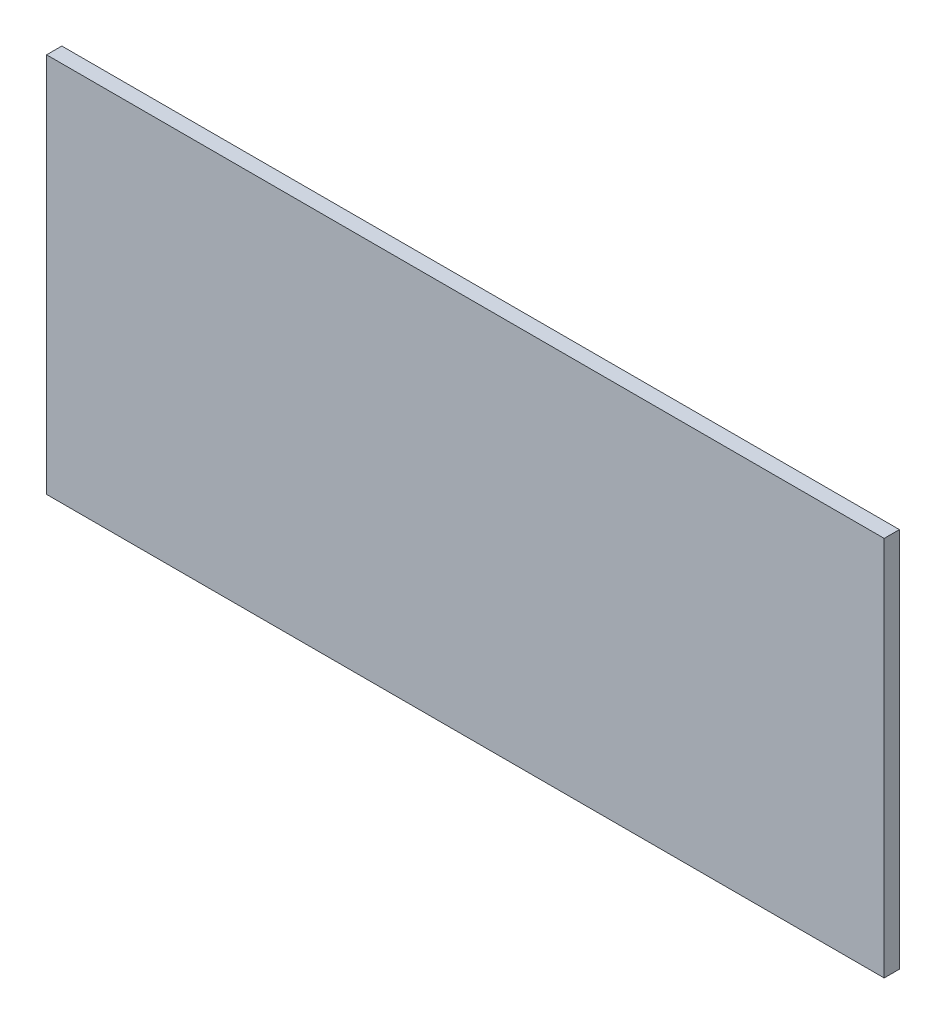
ISO-10303-21;
HEADER;
FILE_DESCRIPTION(('STEP AP214'),'2;1');
FILE_NAME('part.step','',(''),(''),'','','');
FILE_SCHEMA(('AUTOMOTIVE_DESIGN { 1 0 10303 214 1 1 1 1 }'));
ENDSEC;
DATA;
#1=APPLICATION_CONTEXT('core data for automotive mechanical design processes');
#2=APPLICATION_PROTOCOL_DEFINITION('international standard','automotive_design',2000,#1);
#3=PRODUCT_CONTEXT('',#1,'mechanical');
#4=PRODUCT('Part','Part','',(#3));
#5=PRODUCT_RELATED_PRODUCT_CATEGORY('part','',(#4));
#6=PRODUCT_DEFINITION_FORMATION('','',#4);
#7=PRODUCT_DEFINITION_CONTEXT('part definition',#1,'design');
#8=PRODUCT_DEFINITION('design','',#6,#7);
#9=PRODUCT_DEFINITION_SHAPE('','',#8);
#10=(LENGTH_UNIT() NAMED_UNIT(*) SI_UNIT(.MILLI.,.METRE.));
#11=(NAMED_UNIT(*) PLANE_ANGLE_UNIT() SI_UNIT($,.RADIAN.));
#12=(NAMED_UNIT(*) SI_UNIT($,.STERADIAN.) SOLID_ANGLE_UNIT());
#13=UNCERTAINTY_MEASURE_WITH_UNIT(LENGTH_MEASURE(1.E-05),#10,'distance_accuracy_value','');
#14=(GEOMETRIC_REPRESENTATION_CONTEXT(3) GLOBAL_UNCERTAINTY_ASSIGNED_CONTEXT((#13)) GLOBAL_UNIT_ASSIGNED_CONTEXT((#10,
#11,#12)) REPRESENTATION_CONTEXT('',''));
#15=CARTESIAN_POINT('',(0.,0.,0.));
#16=DIRECTION('',(0.,0.,1.));
#17=DIRECTION('',(1.,0.,0.));
#18=AXIS2_PLACEMENT_3D('',#15,#16,#17);
#19=CARTESIAN_POINT('',(-5500.,2500.,200.));
#20=DIRECTION('',(1.,0.,0.));
#21=DIRECTION('',(0.,1.,0.));
#22=AXIS2_PLACEMENT_3D('',#19,#20,#21);
#23=PLANE('',#22);
#24=DIRECTION('',(0.,-1.,0.));
#25=VECTOR('',#24,1.);
#26=CARTESIAN_POINT('',(-5500.,2500.,0.));
#27=LINE('',#26,#25);
#28=CARTESIAN_POINT('',(-5500.,2500.,0.));
#29=VERTEX_POINT('',#28);
#30=CARTESIAN_POINT('',(-5500.,-2500.,0.));
#31=VERTEX_POINT('',#30);
#32=EDGE_CURVE('E101',#29,#31,#27,.T.);
#33=ORIENTED_EDGE('',*,*,#32,.T.);
#34=DIRECTION('',(0.,0.,-1.));
#35=VECTOR('',#34,1.);
#36=CARTESIAN_POINT('',(-5500.,-2500.,200.));
#37=LINE('',#36,#35);
#38=CARTESIAN_POINT('',(-5500.,-2500.,200.));
#39=VERTEX_POINT('',#38);
#40=EDGE_CURVE('E11',#39,#31,#37,.T.);
#41=ORIENTED_EDGE('',*,*,#40,.F.);
#42=DIRECTION('',(0.,-1.,0.));
#43=VECTOR('',#42,1.);
#44=CARTESIAN_POINT('',(-5500.,2500.,200.));
#45=LINE('',#44,#43);
#46=CARTESIAN_POINT('',(-5500.,2500.,200.));
#47=VERTEX_POINT('',#46);
#48=EDGE_CURVE('E89',#47,#39,#45,.T.);
#49=ORIENTED_EDGE('',*,*,#48,.F.);
#50=DIRECTION('',(0.,0.,-1.));
#51=VECTOR('',#50,1.);
#52=CARTESIAN_POINT('',(-5500.,2500.,200.));
#53=LINE('',#52,#51);
#54=EDGE_CURVE('E97',#47,#29,#53,.T.);
#55=ORIENTED_EDGE('',*,*,#54,.T.);
#56=EDGE_LOOP('',(#33,#41,#49,#55));
#57=FACE_BOUND('',#56,.T.);
#58=ADVANCED_FACE('F38',(#57),#23,.F.);
#59=CARTESIAN_POINT('',(-5500.,-2500.,200.));
#60=DIRECTION('',(0.,1.,0.));
#61=DIRECTION('',(0.,0.,1.));
#62=AXIS2_PLACEMENT_3D('',#59,#60,#61);
#63=PLANE('',#62);
#64=DIRECTION('',(1.,0.,0.));
#65=VECTOR('',#64,1.);
#66=CARTESIAN_POINT('',(-5500.,-2500.,0.));
#67=LINE('',#66,#65);
#68=CARTESIAN_POINT('',(5500.,-2500.,0.));
#69=VERTEX_POINT('',#68);
#70=EDGE_CURVE('E93',#31,#69,#67,.T.);
#71=ORIENTED_EDGE('',*,*,#70,.T.);
#72=DIRECTION('',(0.,0.,-1.));
#73=VECTOR('',#72,1.);
#74=CARTESIAN_POINT('',(5500.,-2500.,200.));
#75=LINE('',#74,#73);
#76=CARTESIAN_POINT('',(5500.,-2500.,200.));
#77=VERTEX_POINT('',#76);
#78=EDGE_CURVE('E46',#77,#69,#75,.T.);
#79=ORIENTED_EDGE('',*,*,#78,.F.);
#80=DIRECTION('',(1.,0.,0.));
#81=VECTOR('',#80,1.);
#82=CARTESIAN_POINT('',(-5500.,-2500.,200.));
#83=LINE('',#82,#81);
#84=EDGE_CURVE('E84',#39,#77,#83,.T.);
#85=ORIENTED_EDGE('',*,*,#84,.F.);
#86=ORIENTED_EDGE('',*,*,#40,.T.);
#87=EDGE_LOOP('',(#71,#79,#85,#86));
#88=FACE_BOUND('',#87,.T.);
#89=ADVANCED_FACE('F92',(#88),#63,.F.);
#90=CARTESIAN_POINT('',(5500.,2500.,200.));
#91=DIRECTION('',(-1.,0.,0.));
#92=DIRECTION('',(0.,-1.,0.));
#93=AXIS2_PLACEMENT_3D('',#90,#91,#92);
#94=PLANE('',#93);
#95=DIRECTION('',(0.,1.,0.));
#96=VECTOR('',#95,1.);
#97=CARTESIAN_POINT('',(5500.,2500.,0.));
#98=LINE('',#97,#96);
#99=CARTESIAN_POINT('',(5500.,2500.,0.));
#100=VERTEX_POINT('',#99);
#101=EDGE_CURVE('E71',#69,#100,#98,.T.);
#102=ORIENTED_EDGE('',*,*,#101,.T.);
#103=DIRECTION('',(0.,0.,-1.));
#104=VECTOR('',#103,1.);
#105=CARTESIAN_POINT('',(5500.,2500.,200.));
#106=LINE('',#105,#104);
#107=CARTESIAN_POINT('',(5500.,2500.,200.));
#108=VERTEX_POINT('',#107);
#109=EDGE_CURVE('E94',#108,#100,#106,.T.);
#110=ORIENTED_EDGE('',*,*,#109,.F.);
#111=DIRECTION('',(0.,1.,0.));
#112=VECTOR('',#111,1.);
#113=CARTESIAN_POINT('',(5500.,2500.,200.));
#114=LINE('',#113,#112);
#115=EDGE_CURVE('E87',#77,#108,#114,.T.);
#116=ORIENTED_EDGE('',*,*,#115,.F.);
#117=ORIENTED_EDGE('',*,*,#78,.T.);
#118=EDGE_LOOP('',(#102,#110,#116,#117));
#119=FACE_BOUND('',#118,.T.);
#120=ADVANCED_FACE('F95',(#119),#94,.F.);
#121=CARTESIAN_POINT('',(-5500.,2500.,200.));
#122=DIRECTION('',(0.,-1.,0.));
#123=DIRECTION('',(0.,0.,-1.));
#124=AXIS2_PLACEMENT_3D('',#121,#122,#123);
#125=PLANE('',#124);
#126=DIRECTION('',(-1.,0.,0.));
#127=VECTOR('',#126,1.);
#128=CARTESIAN_POINT('',(-5500.,2500.,0.));
#129=LINE('',#128,#127);
#130=EDGE_CURVE('E77',#100,#29,#129,.T.);
#131=ORIENTED_EDGE('',*,*,#130,.T.);
#132=ORIENTED_EDGE('',*,*,#54,.F.);
#133=DIRECTION('',(-1.,0.,0.));
#134=VECTOR('',#133,1.);
#135=CARTESIAN_POINT('',(-5500.,2500.,200.));
#136=LINE('',#135,#134);
#137=EDGE_CURVE('E54',#108,#47,#136,.T.);
#138=ORIENTED_EDGE('',*,*,#137,.F.);
#139=ORIENTED_EDGE('',*,*,#109,.T.);
#140=EDGE_LOOP('',(#131,#132,#138,#139));
#141=FACE_BOUND('',#140,.T.);
#142=ADVANCED_FACE('F108',(#141),#125,.F.);
#143=CARTESIAN_POINT('',(-5500.,-2500.,200.));
#144=DIRECTION('',(0.,0.,1.));
#145=DIRECTION('',(1.,0.,0.));
#146=AXIS2_PLACEMENT_3D('',#143,#144,#145);
#147=PLANE('',#146);
#148=ORIENTED_EDGE('',*,*,#48,.T.);
#149=ORIENTED_EDGE('',*,*,#84,.T.);
#150=ORIENTED_EDGE('',*,*,#115,.T.);
#151=ORIENTED_EDGE('',*,*,#137,.T.);
#152=EDGE_LOOP('',(#148,#149,#150,#151));
#153=FACE_BOUND('',#152,.T.);
#154=ADVANCED_FACE('F85',(#153),#147,.T.);
#155=CARTESIAN_POINT('',(-5500.,-2500.,0.));
#156=DIRECTION('',(0.,0.,1.));
#157=DIRECTION('',(1.,0.,0.));
#158=AXIS2_PLACEMENT_3D('',#155,#156,#157);
#159=PLANE('',#158);
#160=ORIENTED_EDGE('',*,*,#32,.F.);
#161=ORIENTED_EDGE('',*,*,#130,.F.);
#162=ORIENTED_EDGE('',*,*,#101,.F.);
#163=ORIENTED_EDGE('',*,*,#70,.F.);
#164=EDGE_LOOP('',(#160,#161,#162,#163));
#165=FACE_BOUND('',#164,.T.);
#166=ADVANCED_FACE('F111',(#165),#159,.F.);
#167=CLOSED_SHELL('',(#58,#89,#120,#142,#154,#166));
#168=MANIFOLD_SOLID_BREP('B2',#167);
#169=ADVANCED_BREP_SHAPE_REPRESENTATION('',(#18,#168),#14);
#170=SHAPE_DEFINITION_REPRESENTATION(#9,#169);
ENDSEC;
END-ISO-10303-21;
